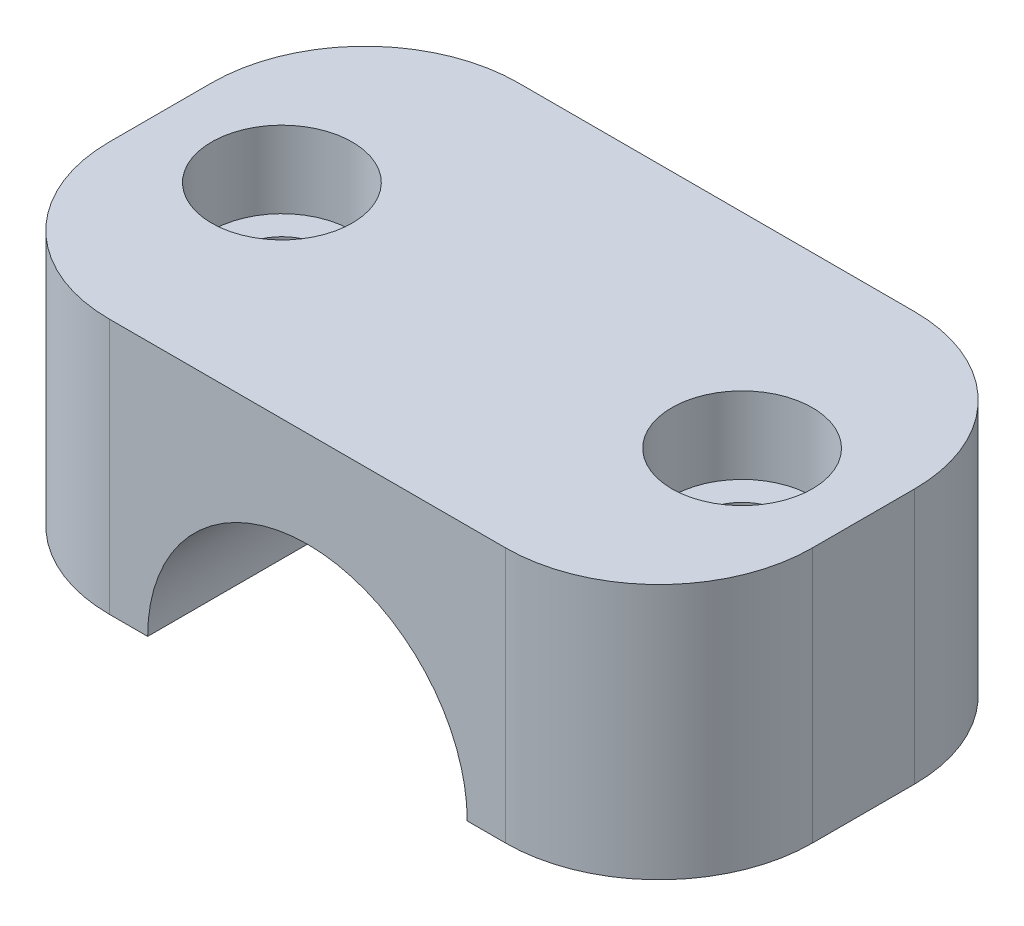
ISO-10303-21;
HEADER;
FILE_DESCRIPTION(('STEP AP214'),'2;1');
FILE_NAME('part.step','',(''),(''),'','','');
FILE_SCHEMA(('AUTOMOTIVE_DESIGN { 1 0 10303 214 1 1 1 1 }'));
ENDSEC;
DATA;
#1=APPLICATION_CONTEXT('core data for automotive mechanical design processes');
#2=APPLICATION_PROTOCOL_DEFINITION('international standard','automotive_design',2000,#1);
#3=PRODUCT_CONTEXT('',#1,'mechanical');
#4=PRODUCT('Part','Part','',(#3));
#5=PRODUCT_RELATED_PRODUCT_CATEGORY('part','',(#4));
#6=PRODUCT_DEFINITION_FORMATION('','',#4);
#7=PRODUCT_DEFINITION_CONTEXT('part definition',#1,'design');
#8=PRODUCT_DEFINITION('design','',#6,#7);
#9=PRODUCT_DEFINITION_SHAPE('','',#8);
#10=(LENGTH_UNIT() NAMED_UNIT(*) SI_UNIT(.MILLI.,.METRE.));
#11=(NAMED_UNIT(*) PLANE_ANGLE_UNIT() SI_UNIT($,.RADIAN.));
#12=(NAMED_UNIT(*) SI_UNIT($,.STERADIAN.) SOLID_ANGLE_UNIT());
#13=UNCERTAINTY_MEASURE_WITH_UNIT(LENGTH_MEASURE(1.E-05),#10,'distance_accuracy_value','');
#14=(GEOMETRIC_REPRESENTATION_CONTEXT(3) GLOBAL_UNCERTAINTY_ASSIGNED_CONTEXT((#13)) GLOBAL_UNIT_ASSIGNED_CONTEXT((#10,
#11,#12)) REPRESENTATION_CONTEXT('',''));
#15=CARTESIAN_POINT('',(0.,0.,0.));
#16=DIRECTION('',(0.,0.,1.));
#17=DIRECTION('',(1.,0.,0.));
#18=AXIS2_PLACEMENT_3D('',#15,#16,#17);
#19=CARTESIAN_POINT('',(-27.5,20.,16.));
#20=DIRECTION('',(0.,-1.,0.));
#21=DIRECTION('',(0.,0.,-1.));
#22=AXIS2_PLACEMENT_3D('',#19,#20,#21);
#23=PLANE('',#22);
#24=CARTESIAN_POINT('',(18.,20.,0.));
#25=DIRECTION('',(0.,1.,0.));
#26=DIRECTION('',(0.,0.,1.));
#27=AXIS2_PLACEMENT_3D('',#24,#25,#26);
#28=CIRCLE('',#27,5.49999999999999);
#29=CARTESIAN_POINT('',(18.,20.,5.49999999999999));
#30=VERTEX_POINT('',#29);
#31=EDGE_CURVE('E216',#30,#30,#28,.T.);
#32=ORIENTED_EDGE('',*,*,#31,.F.);
#33=EDGE_LOOP('',(#32));
#34=FACE_BOUND('',#33,.T.);
#35=DIRECTION('',(-1.,0.,0.));
#36=VECTOR('',#35,1.);
#37=CARTESIAN_POINT('',(-27.5,20.,-16.));
#38=LINE('',#37,#36);
#39=CARTESIAN_POINT('',(15.5,20.,-16.));
#40=VERTEX_POINT('',#39);
#41=CARTESIAN_POINT('',(-15.5,20.,-16.));
#42=VERTEX_POINT('',#41);
#43=EDGE_CURVE('E135',#40,#42,#38,.T.);
#44=ORIENTED_EDGE('',*,*,#43,.T.);
#45=CARTESIAN_POINT('',(-15.5,20.,-4.));
#46=DIRECTION('',(0.,-1.,0.));
#47=DIRECTION('',(0.,0.,-1.));
#48=AXIS2_PLACEMENT_3D('',#45,#46,#47);
#49=CIRCLE('',#48,12.);
#50=CARTESIAN_POINT('',(-27.5,20.,-4.));
#51=VERTEX_POINT('',#50);
#52=EDGE_CURVE('E172',#42,#51,#49,.F.);
#53=ORIENTED_EDGE('',*,*,#52,.T.);
#54=DIRECTION('',(0.,0.,-1.));
#55=VECTOR('',#54,1.);
#56=CARTESIAN_POINT('',(-27.5,20.,16.));
#57=LINE('',#56,#55);
#58=CARTESIAN_POINT('',(-27.5,20.,4.));
#59=VERTEX_POINT('',#58);
#60=EDGE_CURVE('E143',#59,#51,#57,.T.);
#61=ORIENTED_EDGE('',*,*,#60,.F.);
#62=CARTESIAN_POINT('',(-15.5,20.,4.));
#63=DIRECTION('',(0.,-1.,0.));
#64=DIRECTION('',(0.,0.,-1.));
#65=AXIS2_PLACEMENT_3D('',#62,#63,#64);
#66=CIRCLE('',#65,12.);
#67=CARTESIAN_POINT('',(-15.5,20.,16.));
#68=VERTEX_POINT('',#67);
#69=EDGE_CURVE('E166',#59,#68,#66,.F.);
#70=ORIENTED_EDGE('',*,*,#69,.T.);
#71=DIRECTION('',(-1.,0.,0.));
#72=VECTOR('',#71,1.);
#73=CARTESIAN_POINT('',(-27.5,20.,16.));
#74=LINE('',#73,#72);
#75=CARTESIAN_POINT('',(15.5,20.,16.));
#76=VERTEX_POINT('',#75);
#77=EDGE_CURVE('E139',#76,#68,#74,.T.);
#78=ORIENTED_EDGE('',*,*,#77,.F.);
#79=CARTESIAN_POINT('',(15.5,20.,4.));
#80=DIRECTION('',(0.,-1.,0.));
#81=DIRECTION('',(0.,0.,-1.));
#82=AXIS2_PLACEMENT_3D('',#79,#80,#81);
#83=CIRCLE('',#82,12.);
#84=CARTESIAN_POINT('',(27.5,20.,4.));
#85=VERTEX_POINT('',#84);
#86=EDGE_CURVE('E168',#76,#85,#83,.F.);
#87=ORIENTED_EDGE('',*,*,#86,.T.);
#88=DIRECTION('',(0.,0.,-1.));
#89=VECTOR('',#88,1.);
#90=CARTESIAN_POINT('',(27.5,20.,16.));
#91=LINE('',#90,#89);
#92=CARTESIAN_POINT('',(27.5,20.,-4.));
#93=VERTEX_POINT('',#92);
#94=EDGE_CURVE('E146',#85,#93,#91,.T.);
#95=ORIENTED_EDGE('',*,*,#94,.T.);
#96=CARTESIAN_POINT('',(15.5,20.,-4.));
#97=DIRECTION('',(0.,-1.,0.));
#98=DIRECTION('',(0.,0.,-1.));
#99=AXIS2_PLACEMENT_3D('',#96,#97,#98);
#100=CIRCLE('',#99,12.);
#101=EDGE_CURVE('E170',#93,#40,#100,.F.);
#102=ORIENTED_EDGE('',*,*,#101,.T.);
#103=EDGE_LOOP('',(#44,#53,#61,#70,#78,#87,#95,#102));
#104=FACE_BOUND('',#103,.T.);
#105=CARTESIAN_POINT('',(-18.,20.,0.));
#106=DIRECTION('',(0.,1.,0.));
#107=DIRECTION('',(0.,0.,1.));
#108=AXIS2_PLACEMENT_3D('',#105,#106,#107);
#109=CIRCLE('',#108,5.49999999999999);
#110=CARTESIAN_POINT('',(-18.,20.,5.49999999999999));
#111=VERTEX_POINT('',#110);
#112=EDGE_CURVE('E204',#111,#111,#109,.T.);
#113=ORIENTED_EDGE('',*,*,#112,.F.);
#114=EDGE_LOOP('',(#113));
#115=FACE_BOUND('',#114,.T.);
#116=ADVANCED_FACE('F33',(#34,#104,#115),#23,.F.);
#117=CARTESIAN_POINT('',(-27.5,0.,16.));
#118=DIRECTION('',(0.,1.,0.));
#119=DIRECTION('',(0.,0.,1.));
#120=AXIS2_PLACEMENT_3D('',#117,#118,#119);
#121=PLANE('',#120);
#122=CARTESIAN_POINT('',(-18.,0.,0.));
#123=DIRECTION('',(0.,1.,0.));
#124=DIRECTION('',(0.,0.,1.));
#125=AXIS2_PLACEMENT_3D('',#122,#123,#124);
#126=CIRCLE('',#125,3.3);
#127=CARTESIAN_POINT('',(-18.,0.,3.3));
#128=VERTEX_POINT('',#127);
#129=EDGE_CURVE('E194',#128,#128,#126,.T.);
#130=ORIENTED_EDGE('',*,*,#129,.T.);
#131=EDGE_LOOP('',(#130));
#132=FACE_BOUND('',#131,.T.);
#133=DIRECTION('',(0.,0.,-1.));
#134=VECTOR('',#133,1.);
#135=CARTESIAN_POINT('',(-27.5,0.,16.));
#136=LINE('',#135,#134);
#137=CARTESIAN_POINT('',(-27.5,0.,4.));
#138=VERTEX_POINT('',#137);
#139=CARTESIAN_POINT('',(-27.5,0.,-4.));
#140=VERTEX_POINT('',#139);
#141=EDGE_CURVE('E151',#138,#140,#136,.T.);
#142=ORIENTED_EDGE('',*,*,#141,.T.);
#143=CARTESIAN_POINT('',(-15.5,0.,-4.));
#144=DIRECTION('',(0.,1.,0.));
#145=DIRECTION('',(0.,0.,1.));
#146=AXIS2_PLACEMENT_3D('',#143,#144,#145);
#147=CIRCLE('',#146,12.);
#148=CARTESIAN_POINT('',(-15.5,0.,-16.));
#149=VERTEX_POINT('',#148);
#150=EDGE_CURVE('E161',#140,#149,#147,.F.);
#151=ORIENTED_EDGE('',*,*,#150,.T.);
#152=DIRECTION('',(1.,0.,0.));
#153=VECTOR('',#152,1.);
#154=CARTESIAN_POINT('',(-27.5,0.,-16.));
#155=LINE('',#154,#153);
#156=CARTESIAN_POINT('',(-12.5,0.,-16.));
#157=VERTEX_POINT('',#156);
#158=EDGE_CURVE('E133',#149,#157,#155,.T.);
#159=ORIENTED_EDGE('',*,*,#158,.T.);
#160=DIRECTION('',(0.,0.,1.));
#161=VECTOR('',#160,1.);
#162=CARTESIAN_POINT('',(-12.5,0.,-16.));
#163=LINE('',#162,#161);
#164=CARTESIAN_POINT('',(-12.5,0.,16.));
#165=VERTEX_POINT('',#164);
#166=EDGE_CURVE('E119',#157,#165,#163,.T.);
#167=ORIENTED_EDGE('',*,*,#166,.T.);
#168=DIRECTION('',(1.,0.,0.));
#169=VECTOR('',#168,1.);
#170=CARTESIAN_POINT('',(-27.5,0.,16.));
#171=LINE('',#170,#169);
#172=CARTESIAN_POINT('',(-15.5,0.,16.));
#173=VERTEX_POINT('',#172);
#174=EDGE_CURVE('E186',#173,#165,#171,.T.);
#175=ORIENTED_EDGE('',*,*,#174,.F.);
#176=CARTESIAN_POINT('',(-15.5,0.,4.));
#177=DIRECTION('',(0.,1.,0.));
#178=DIRECTION('',(0.,0.,1.));
#179=AXIS2_PLACEMENT_3D('',#176,#177,#178);
#180=CIRCLE('',#179,12.);
#181=EDGE_CURVE('E159',#173,#138,#180,.F.);
#182=ORIENTED_EDGE('',*,*,#181,.T.);
#183=EDGE_LOOP('',(#142,#151,#159,#167,#175,#182));
#184=FACE_BOUND('',#183,.T.);
#185=ADVANCED_FACE('F191',(#132,#184),#121,.F.);
#186=CARTESIAN_POINT('',(-27.5,0.,16.));
#187=DIRECTION('',(1.,0.,0.));
#188=DIRECTION('',(0.,0.,-1.));
#189=AXIS2_PLACEMENT_3D('',#186,#187,#188);
#190=PLANE('',#189);
#191=ORIENTED_EDGE('',*,*,#60,.T.);
#192=DIRECTION('',(0.,-1.,0.));
#193=VECTOR('',#192,1.);
#194=CARTESIAN_POINT('',(-27.5,0.,-4.));
#195=LINE('',#194,#193);
#196=EDGE_CURVE('E156',#51,#140,#195,.T.);
#197=ORIENTED_EDGE('',*,*,#196,.T.);
#198=ORIENTED_EDGE('',*,*,#141,.F.);
#199=DIRECTION('',(0.,-1.,0.));
#200=VECTOR('',#199,1.);
#201=CARTESIAN_POINT('',(-27.5,0.,4.));
#202=LINE('',#201,#200);
#203=EDGE_CURVE('E154',#138,#59,#202,.F.);
#204=ORIENTED_EDGE('',*,*,#203,.T.);
#205=EDGE_LOOP('',(#191,#197,#198,#204));
#206=FACE_BOUND('',#205,.T.);
#207=ADVANCED_FACE('F264',(#206),#190,.F.);
#208=CARTESIAN_POINT('',(18.,0.,0.));
#209=DIRECTION('',(0.,1.,0.));
#210=DIRECTION('',(0.,0.,1.));
#211=AXIS2_PLACEMENT_3D('',#208,#209,#210);
#212=CIRCLE('',#211,3.3);
#213=CARTESIAN_POINT('',(18.,0.,3.3));
#214=VERTEX_POINT('',#213);
#215=EDGE_CURVE('E207',#214,#214,#212,.T.);
#216=ORIENTED_EDGE('',*,*,#215,.T.);
#217=EDGE_LOOP('',(#216));
#218=FACE_BOUND('',#217,.T.);
#219=CARTESIAN_POINT('',(12.5,0.,-16.));
#220=VERTEX_POINT('',#219);
#221=CARTESIAN_POINT('',(15.5,0.,-16.));
#222=VERTEX_POINT('',#221);
#223=EDGE_CURVE('E126',#220,#222,#155,.T.);
#224=ORIENTED_EDGE('',*,*,#223,.T.);
#225=CARTESIAN_POINT('',(15.5,0.,-4.));
#226=DIRECTION('',(0.,1.,0.));
#227=DIRECTION('',(0.,0.,1.));
#228=AXIS2_PLACEMENT_3D('',#225,#226,#227);
#229=CIRCLE('',#228,12.);
#230=CARTESIAN_POINT('',(27.5,0.,-4.));
#231=VERTEX_POINT('',#230);
#232=EDGE_CURVE('E54',#222,#231,#229,.F.);
#233=ORIENTED_EDGE('',*,*,#232,.T.);
#234=DIRECTION('',(0.,0.,-1.));
#235=VECTOR('',#234,1.);
#236=CARTESIAN_POINT('',(27.5,0.,16.));
#237=LINE('',#236,#235);
#238=CARTESIAN_POINT('',(27.5,0.,4.));
#239=VERTEX_POINT('',#238);
#240=EDGE_CURVE('E149',#239,#231,#237,.T.);
#241=ORIENTED_EDGE('',*,*,#240,.F.);
#242=CARTESIAN_POINT('',(15.5,0.,4.));
#243=DIRECTION('',(0.,1.,0.));
#244=DIRECTION('',(0.,0.,1.));
#245=AXIS2_PLACEMENT_3D('',#242,#243,#244);
#246=CIRCLE('',#245,12.);
#247=CARTESIAN_POINT('',(15.5,0.,16.));
#248=VERTEX_POINT('',#247);
#249=EDGE_CURVE('E48',#239,#248,#246,.F.);
#250=ORIENTED_EDGE('',*,*,#249,.T.);
#251=CARTESIAN_POINT('',(12.5,0.,16.));
#252=VERTEX_POINT('',#251);
#253=EDGE_CURVE('E127',#252,#248,#171,.T.);
#254=ORIENTED_EDGE('',*,*,#253,.F.);
#255=DIRECTION('',(0.,0.,1.));
#256=VECTOR('',#255,1.);
#257=CARTESIAN_POINT('',(12.5,0.,-16.));
#258=LINE('',#257,#256);
#259=EDGE_CURVE('E116',#252,#220,#258,.F.);
#260=ORIENTED_EDGE('',*,*,#259,.T.);
#261=EDGE_LOOP('',(#224,#233,#241,#250,#254,#260));
#262=FACE_BOUND('',#261,.T.);
#263=ADVANCED_FACE('F125',(#218,#262),#121,.F.);
#264=CARTESIAN_POINT('',(27.5,0.,16.));
#265=DIRECTION('',(-1.,0.,0.));
#266=DIRECTION('',(0.,0.,1.));
#267=AXIS2_PLACEMENT_3D('',#264,#265,#266);
#268=PLANE('',#267);
#269=ORIENTED_EDGE('',*,*,#240,.T.);
#270=DIRECTION('',(0.,1.,0.));
#271=VECTOR('',#270,1.);
#272=CARTESIAN_POINT('',(27.5,20.,-4.));
#273=LINE('',#272,#271);
#274=EDGE_CURVE('E176',#231,#93,#273,.T.);
#275=ORIENTED_EDGE('',*,*,#274,.T.);
#276=ORIENTED_EDGE('',*,*,#94,.F.);
#277=DIRECTION('',(0.,1.,0.));
#278=VECTOR('',#277,1.);
#279=CARTESIAN_POINT('',(27.5,0.,4.));
#280=LINE('',#279,#278);
#281=EDGE_CURVE('E174',#85,#239,#280,.F.);
#282=ORIENTED_EDGE('',*,*,#281,.T.);
#283=EDGE_LOOP('',(#269,#275,#276,#282));
#284=FACE_BOUND('',#283,.T.);
#285=ADVANCED_FACE('F256',(#284),#268,.F.);
#286=CARTESIAN_POINT('',(0.,0.,16.));
#287=DIRECTION('',(0.,0.,-1.));
#288=DIRECTION('',(-1.,0.,0.));
#289=AXIS2_PLACEMENT_3D('',#286,#287,#288);
#290=PLANE('',#289);
#291=ORIENTED_EDGE('',*,*,#253,.T.);
#292=DIRECTION('',(0.,1.,0.));
#293=VECTOR('',#292,1.);
#294=CARTESIAN_POINT('',(15.5,0.,16.));
#295=LINE('',#294,#293);
#296=EDGE_CURVE('E11',#248,#76,#295,.T.);
#297=ORIENTED_EDGE('',*,*,#296,.T.);
#298=ORIENTED_EDGE('',*,*,#77,.T.);
#299=DIRECTION('',(0.,-1.,0.));
#300=VECTOR('',#299,1.);
#301=CARTESIAN_POINT('',(-15.5,0.,16.));
#302=LINE('',#301,#300);
#303=EDGE_CURVE('E41',#68,#173,#302,.T.);
#304=ORIENTED_EDGE('',*,*,#303,.T.);
#305=ORIENTED_EDGE('',*,*,#174,.T.);
#306=CARTESIAN_POINT('',(0.,0.,16.));
#307=DIRECTION('',(0.,0.,1.));
#308=DIRECTION('',(1.,0.,0.));
#309=AXIS2_PLACEMENT_3D('',#306,#307,#308);
#310=CIRCLE('',#309,12.5);
#311=EDGE_CURVE('E123',#252,#165,#310,.T.);
#312=ORIENTED_EDGE('',*,*,#311,.F.);
#313=EDGE_LOOP('',(#291,#297,#298,#304,#305,#312));
#314=FACE_BOUND('',#313,.T.);
#315=ADVANCED_FACE('F185',(#314),#290,.F.);
#316=CARTESIAN_POINT('',(0.,0.,-16.));
#317=DIRECTION('',(0.,0.,-1.));
#318=DIRECTION('',(-1.,0.,0.));
#319=AXIS2_PLACEMENT_3D('',#316,#317,#318);
#320=PLANE('',#319);
#321=ORIENTED_EDGE('',*,*,#158,.F.);
#322=DIRECTION('',(0.,-1.,0.));
#323=VECTOR('',#322,1.);
#324=CARTESIAN_POINT('',(-15.5,20.,-16.));
#325=LINE('',#324,#323);
#326=EDGE_CURVE('E164',#149,#42,#325,.F.);
#327=ORIENTED_EDGE('',*,*,#326,.T.);
#328=ORIENTED_EDGE('',*,*,#43,.F.);
#329=DIRECTION('',(0.,1.,0.));
#330=VECTOR('',#329,1.);
#331=CARTESIAN_POINT('',(15.5,0.,-16.));
#332=LINE('',#331,#330);
#333=EDGE_CURVE('E132',#40,#222,#332,.F.);
#334=ORIENTED_EDGE('',*,*,#333,.T.);
#335=ORIENTED_EDGE('',*,*,#223,.F.);
#336=CARTESIAN_POINT('',(0.,0.,-16.));
#337=DIRECTION('',(0.,0.,1.));
#338=DIRECTION('',(1.,0.,0.));
#339=AXIS2_PLACEMENT_3D('',#336,#337,#338);
#340=CIRCLE('',#339,12.5);
#341=EDGE_CURVE('E112',#220,#157,#340,.T.);
#342=ORIENTED_EDGE('',*,*,#341,.T.);
#343=EDGE_LOOP('',(#321,#327,#328,#334,#335,#342));
#344=FACE_BOUND('',#343,.T.);
#345=ADVANCED_FACE('F129',(#344),#320,.T.);
#346=CARTESIAN_POINT('',(0.,0.,-16.));
#347=DIRECTION('',(0.,0.,1.));
#348=DIRECTION('',(1.,0.,0.));
#349=AXIS2_PLACEMENT_3D('',#346,#347,#348);
#350=CYLINDRICAL_SURFACE('',#349,12.5);
#351=ORIENTED_EDGE('',*,*,#341,.F.);
#352=ORIENTED_EDGE('',*,*,#259,.F.);
#353=ORIENTED_EDGE('',*,*,#311,.T.);
#354=ORIENTED_EDGE('',*,*,#166,.F.);
#355=EDGE_LOOP('',(#351,#352,#353,#354));
#356=FACE_BOUND('',#355,.T.);
#357=ADVANCED_FACE('F114',(#356),#350,.F.);
#358=CARTESIAN_POINT('',(-15.5,0.,-4.));
#359=DIRECTION('',(0.,1.,0.));
#360=DIRECTION('',(0.,0.,1.));
#361=AXIS2_PLACEMENT_3D('',#358,#359,#360);
#362=CYLINDRICAL_SURFACE('',#361,12.);
#363=ORIENTED_EDGE('',*,*,#52,.F.);
#364=ORIENTED_EDGE('',*,*,#326,.F.);
#365=ORIENTED_EDGE('',*,*,#150,.F.);
#366=ORIENTED_EDGE('',*,*,#196,.F.);
#367=EDGE_LOOP('',(#363,#364,#365,#366));
#368=FACE_BOUND('',#367,.T.);
#369=ADVANCED_FACE('F253',(#368),#362,.T.);
#370=CARTESIAN_POINT('',(15.5,0.,-4.));
#371=DIRECTION('',(0.,-1.,0.));
#372=DIRECTION('',(0.,0.,-1.));
#373=AXIS2_PLACEMENT_3D('',#370,#371,#372);
#374=CYLINDRICAL_SURFACE('',#373,12.);
#375=ORIENTED_EDGE('',*,*,#232,.F.);
#376=ORIENTED_EDGE('',*,*,#333,.F.);
#377=ORIENTED_EDGE('',*,*,#101,.F.);
#378=ORIENTED_EDGE('',*,*,#274,.F.);
#379=EDGE_LOOP('',(#375,#376,#377,#378));
#380=FACE_BOUND('',#379,.T.);
#381=ADVANCED_FACE('F271',(#380),#374,.T.);
#382=CARTESIAN_POINT('',(15.5,0.,4.));
#383=DIRECTION('',(0.,1.,0.));
#384=DIRECTION('',(0.,0.,1.));
#385=AXIS2_PLACEMENT_3D('',#382,#383,#384);
#386=CYLINDRICAL_SURFACE('',#385,12.);
#387=ORIENTED_EDGE('',*,*,#249,.F.);
#388=ORIENTED_EDGE('',*,*,#281,.F.);
#389=ORIENTED_EDGE('',*,*,#86,.F.);
#390=ORIENTED_EDGE('',*,*,#296,.F.);
#391=EDGE_LOOP('',(#387,#388,#389,#390));
#392=FACE_BOUND('',#391,.T.);
#393=ADVANCED_FACE('F274',(#392),#386,.T.);
#394=CARTESIAN_POINT('',(-15.5,0.,4.));
#395=DIRECTION('',(0.,-1.,0.));
#396=DIRECTION('',(0.,0.,-1.));
#397=AXIS2_PLACEMENT_3D('',#394,#395,#396);
#398=CYLINDRICAL_SURFACE('',#397,12.);
#399=ORIENTED_EDGE('',*,*,#69,.F.);
#400=ORIENTED_EDGE('',*,*,#203,.F.);
#401=ORIENTED_EDGE('',*,*,#181,.F.);
#402=ORIENTED_EDGE('',*,*,#303,.F.);
#403=EDGE_LOOP('',(#399,#400,#401,#402));
#404=FACE_BOUND('',#403,.T.);
#405=ADVANCED_FACE('F35',(#404),#398,.T.);
#406=CARTESIAN_POINT('',(-18.,20.,0.));
#407=DIRECTION('',(0.,1.,0.));
#408=DIRECTION('',(0.,0.,1.));
#409=AXIS2_PLACEMENT_3D('',#406,#407,#408);
#410=CYLINDRICAL_SURFACE('',#409,3.30000000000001);
#411=ORIENTED_EDGE('',*,*,#129,.F.);
#412=EDGE_LOOP('',(#411));
#413=FACE_BOUND('',#412,.T.);
#414=CARTESIAN_POINT('',(-18.,14.,0.));
#415=DIRECTION('',(0.,1.,0.));
#416=DIRECTION('',(0.,0.,1.));
#417=AXIS2_PLACEMENT_3D('',#414,#415,#416);
#418=CIRCLE('',#417,3.30000000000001);
#419=CARTESIAN_POINT('',(-18.,14.,3.30000000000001));
#420=VERTEX_POINT('',#419);
#421=EDGE_CURVE('E198',#420,#420,#418,.T.);
#422=ORIENTED_EDGE('',*,*,#421,.T.);
#423=EDGE_LOOP('',(#422));
#424=FACE_BOUND('',#423,.T.);
#425=ADVANCED_FACE('F242',(#413,#424),#410,.F.);
#426=CARTESIAN_POINT('',(-14.7,14.,0.));
#427=DIRECTION('',(0.,-1.,0.));
#428=DIRECTION('',(0.,0.,-1.));
#429=AXIS2_PLACEMENT_3D('',#426,#427,#428);
#430=PLANE('',#429);
#431=ORIENTED_EDGE('',*,*,#421,.F.);
#432=EDGE_LOOP('',(#431));
#433=FACE_BOUND('',#432,.T.);
#434=CARTESIAN_POINT('',(-18.,14.,0.));
#435=DIRECTION('',(0.,1.,0.));
#436=DIRECTION('',(0.,0.,1.));
#437=AXIS2_PLACEMENT_3D('',#434,#435,#436);
#438=CIRCLE('',#437,5.49999999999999);
#439=CARTESIAN_POINT('',(-18.,14.,5.49999999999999));
#440=VERTEX_POINT('',#439);
#441=EDGE_CURVE('E201',#440,#440,#438,.T.);
#442=ORIENTED_EDGE('',*,*,#441,.T.);
#443=EDGE_LOOP('',(#442));
#444=FACE_BOUND('',#443,.T.);
#445=ADVANCED_FACE('F232',(#433,#444),#430,.F.);
#446=CARTESIAN_POINT('',(-18.,20.,0.));
#447=DIRECTION('',(0.,1.,0.));
#448=DIRECTION('',(0.,0.,1.));
#449=AXIS2_PLACEMENT_3D('',#446,#447,#448);
#450=CYLINDRICAL_SURFACE('',#449,5.49999999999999);
#451=ORIENTED_EDGE('',*,*,#441,.F.);
#452=EDGE_LOOP('',(#451));
#453=FACE_BOUND('',#452,.T.);
#454=ORIENTED_EDGE('',*,*,#112,.T.);
#455=EDGE_LOOP('',(#454));
#456=FACE_BOUND('',#455,.T.);
#457=ADVANCED_FACE('F229',(#453,#456),#450,.F.);
#458=CARTESIAN_POINT('',(18.,20.,0.));
#459=DIRECTION('',(0.,1.,0.));
#460=DIRECTION('',(0.,0.,1.));
#461=AXIS2_PLACEMENT_3D('',#458,#459,#460);
#462=CYLINDRICAL_SURFACE('',#461,3.30000000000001);
#463=ORIENTED_EDGE('',*,*,#215,.F.);
#464=EDGE_LOOP('',(#463));
#465=FACE_BOUND('',#464,.T.);
#466=CARTESIAN_POINT('',(18.,14.,0.));
#467=DIRECTION('',(0.,1.,0.));
#468=DIRECTION('',(0.,0.,1.));
#469=AXIS2_PLACEMENT_3D('',#466,#467,#468);
#470=CIRCLE('',#469,3.30000000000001);
#471=CARTESIAN_POINT('',(18.,14.,3.30000000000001));
#472=VERTEX_POINT('',#471);
#473=EDGE_CURVE('E210',#472,#472,#470,.T.);
#474=ORIENTED_EDGE('',*,*,#473,.T.);
#475=EDGE_LOOP('',(#474));
#476=FACE_BOUND('',#475,.T.);
#477=ADVANCED_FACE('F231',(#465,#476),#462,.F.);
#478=CARTESIAN_POINT('',(21.3,14.,0.));
#479=DIRECTION('',(0.,-1.,0.));
#480=DIRECTION('',(0.,0.,-1.));
#481=AXIS2_PLACEMENT_3D('',#478,#479,#480);
#482=PLANE('',#481);
#483=ORIENTED_EDGE('',*,*,#473,.F.);
#484=EDGE_LOOP('',(#483));
#485=FACE_BOUND('',#484,.T.);
#486=CARTESIAN_POINT('',(18.,14.,0.));
#487=DIRECTION('',(0.,1.,0.));
#488=DIRECTION('',(0.,0.,1.));
#489=AXIS2_PLACEMENT_3D('',#486,#487,#488);
#490=CIRCLE('',#489,5.49999999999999);
#491=CARTESIAN_POINT('',(18.,14.,5.49999999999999));
#492=VERTEX_POINT('',#491);
#493=EDGE_CURVE('E213',#492,#492,#490,.T.);
#494=ORIENTED_EDGE('',*,*,#493,.T.);
#495=EDGE_LOOP('',(#494));
#496=FACE_BOUND('',#495,.T.);
#497=ADVANCED_FACE('F239',(#485,#496),#482,.F.);
#498=CARTESIAN_POINT('',(18.,20.,0.));
#499=DIRECTION('',(0.,1.,0.));
#500=DIRECTION('',(0.,0.,1.));
#501=AXIS2_PLACEMENT_3D('',#498,#499,#500);
#502=CYLINDRICAL_SURFACE('',#501,5.49999999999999);
#503=ORIENTED_EDGE('',*,*,#493,.F.);
#504=EDGE_LOOP('',(#503));
#505=FACE_BOUND('',#504,.T.);
#506=ORIENTED_EDGE('',*,*,#31,.T.);
#507=EDGE_LOOP('',(#506));
#508=FACE_BOUND('',#507,.T.);
#509=ADVANCED_FACE('F220',(#505,#508),#502,.F.);
#510=CLOSED_SHELL('',(#116,#185,#207,#263,#285,#315,#345,#357,#369,#381,#393,#405,#425,#445,
#457,#477,#497,#509));
#511=MANIFOLD_SOLID_BREP('B2',#510);
#512=ADVANCED_BREP_SHAPE_REPRESENTATION('',(#18,#511),#14);
#513=SHAPE_DEFINITION_REPRESENTATION(#9,#512);
ENDSEC;
END-ISO-10303-21;
